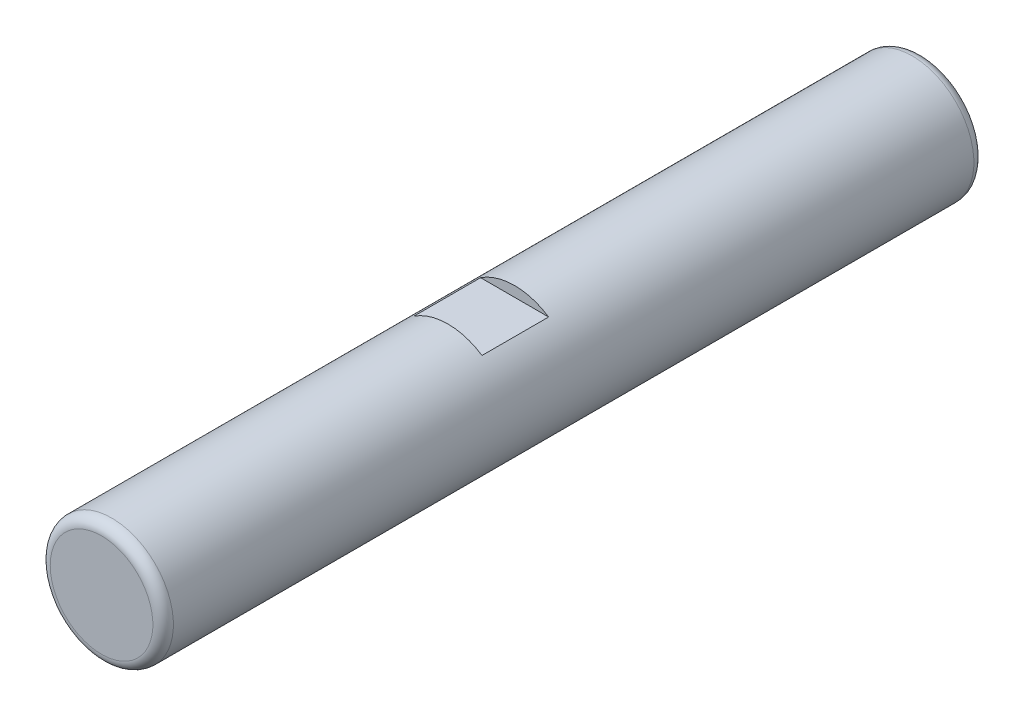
from build123d import *

# Parameters (mm, degrees)
CUT_EXTRUDE1_START = 7.9375
SKETCH4_W          = 31.75
SKETCH4_H          = 10.3124
CUT_EXTRUDE1_DEPTH = 82.977244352


with BuildPart() as part:
    # Logo3_bib1 → Revolve1 (revolve)
    with BuildSketch(Plane(origin=(0, 0, 0), x_dir=(-1, 0, 0), z_dir=(0, -1, 0))):
        with BuildLine():
            Line((0, 38.1), (0, -88.9))
            Line((0, -88.9), (7.9375, -88.9))
            ThreePointArc((7.9375, -88.9), (9.060032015, -88.435032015), (9.525, -87.3125))
            Line((9.525, -87.3125), (9.525, -9.525))
            Line((9.525, -9.525), (9.525, 36.5125))
            ThreePointArc((9.525, 36.5125), (9.060032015, 37.635032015), (7.9375, 38.1))
            Line((7.9375, 38.1), (0, 38.1))
        make_face()
    revolve(axis=Axis((0, 0, -41.537203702), (0, 0, 1)))

    # Sketch4 → Cut-Extrude1 (cut, through all)
    with BuildSketch(Plane(origin=(0, 0, 0), x_dir=(1, 0, 0), z_dir=(0, 1, 0)).offset(CUT_EXTRUDE1_START)):
        with Locations((0, -30.1625)):
            Rectangle(SKETCH4_W, SKETCH4_H)
    extrude(amount=CUT_EXTRUDE1_DEPTH, mode=Mode.SUBTRACT)


solid = part.part
